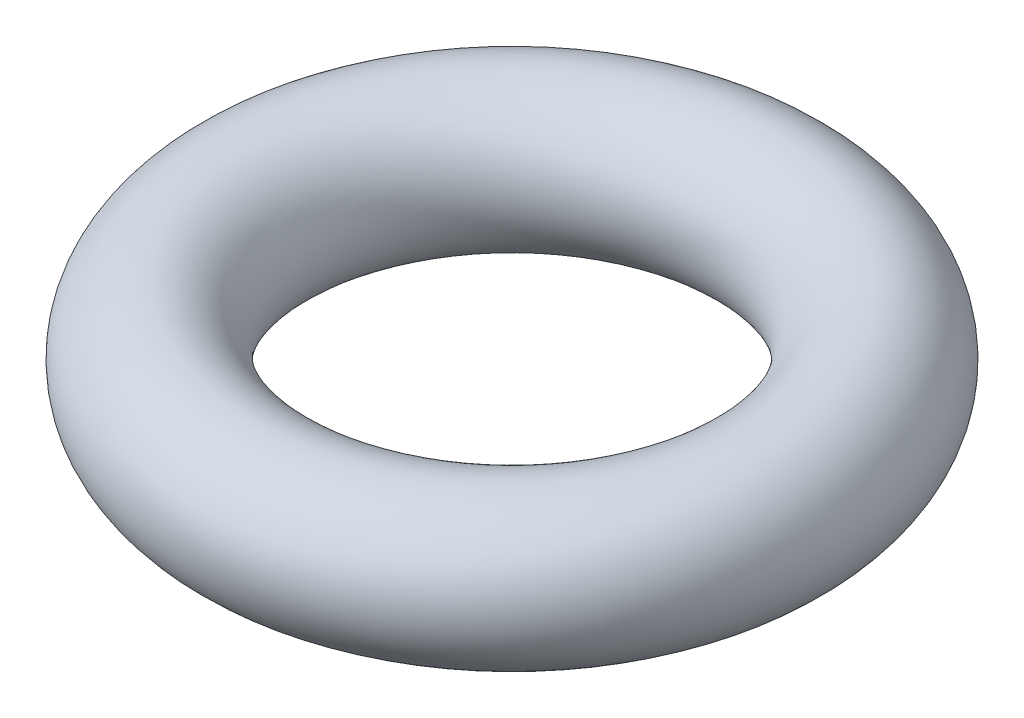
from build123d import *

# Parameters (mm, degrees)
SKETCH1_R = 0.889


with BuildPart() as part:
    # Sketch1 → Revolve1 (revolve)
    with BuildSketch(Plane.XY, mode=Mode.PRIVATE) as revolve1_sk:
        with Locations((3.1242, 0)):
            Circle(SKETCH1_R)
    revolve(revolve1_sk.sketch.rotate(Axis((0, -979.826032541, 0), (0, 1, 0)), 90), axis=Axis((0, -979.826032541, 0), (0, 1, 0)))


solid = part.part
